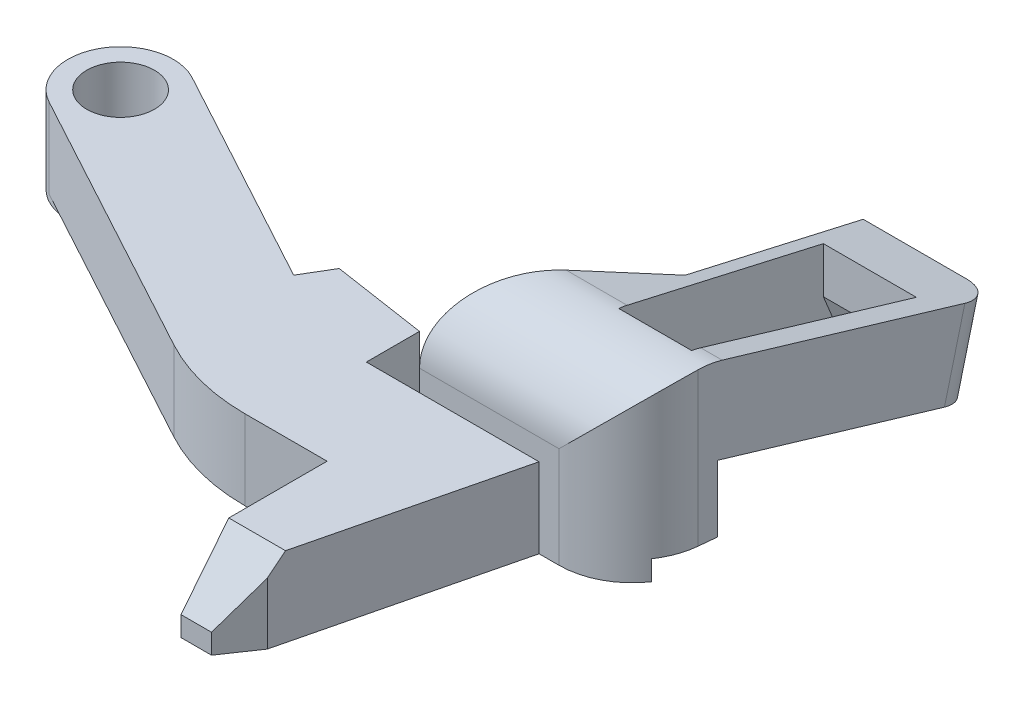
ISO-10303-21;
HEADER;
FILE_DESCRIPTION(('STEP AP214'),'2;1');
FILE_NAME('part.step','',(''),(''),'','','');
FILE_SCHEMA(('AUTOMOTIVE_DESIGN { 1 0 10303 214 1 1 1 1 }'));
ENDSEC;
DATA;
#1=APPLICATION_CONTEXT('core data for automotive mechanical design processes');
#2=APPLICATION_PROTOCOL_DEFINITION('international standard','automotive_design',2000,#1);
#3=PRODUCT_CONTEXT('',#1,'mechanical');
#4=PRODUCT('Part','Part','',(#3));
#5=PRODUCT_RELATED_PRODUCT_CATEGORY('part','',(#4));
#6=PRODUCT_DEFINITION_FORMATION('','',#4);
#7=PRODUCT_DEFINITION_CONTEXT('part definition',#1,'design');
#8=PRODUCT_DEFINITION('design','',#6,#7);
#9=PRODUCT_DEFINITION_SHAPE('','',#8);
#10=(LENGTH_UNIT() NAMED_UNIT(*) SI_UNIT(.MILLI.,.METRE.));
#11=(NAMED_UNIT(*) PLANE_ANGLE_UNIT() SI_UNIT($,.RADIAN.));
#12=(NAMED_UNIT(*) SI_UNIT($,.STERADIAN.) SOLID_ANGLE_UNIT());
#13=UNCERTAINTY_MEASURE_WITH_UNIT(LENGTH_MEASURE(1.E-05),#10,'distance_accuracy_value','');
#14=(GEOMETRIC_REPRESENTATION_CONTEXT(3) GLOBAL_UNCERTAINTY_ASSIGNED_CONTEXT((#13)) GLOBAL_UNIT_ASSIGNED_CONTEXT((#10,
#11,#12)) REPRESENTATION_CONTEXT('',''));
#15=CARTESIAN_POINT('',(0.,0.,0.));
#16=DIRECTION('',(0.,0.,1.));
#17=DIRECTION('',(1.,0.,0.));
#18=AXIS2_PLACEMENT_3D('',#15,#16,#17);
#19=CARTESIAN_POINT('',(0.,0.,0.));
#20=DIRECTION('',(0.,1.,0.));
#21=DIRECTION('',(0.,0.,1.));
#22=AXIS2_PLACEMENT_3D('',#19,#20,#21);
#23=PLANE('',#22);
#24=CARTESIAN_POINT('',(52.705,0.,3.78931625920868));
#25=DIRECTION('',(0.,1.,0.));
#26=DIRECTION('',(0.,0.,1.));
#27=AXIS2_PLACEMENT_3D('',#24,#25,#26);
#28=CIRCLE('',#27,7.00568374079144);
#29=CARTESIAN_POINT('',(52.705,0.,10.7950000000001));
#30=VERTEX_POINT('',#29);
#31=CARTESIAN_POINT('',(58.4856871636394,0.,7.747));
#32=VERTEX_POINT('',#31);
#33=EDGE_CURVE('E290',#30,#32,#28,.T.);
#34=ORIENTED_EDGE('',*,*,#33,.F.);
#35=DIRECTION('',(-1.,0.,0.));
#36=VECTOR('',#35,1.);
#37=CARTESIAN_POINT('',(62.23,0.,10.795));
#38=LINE('',#37,#36);
#39=CARTESIAN_POINT('',(50.8,0.,10.795));
#40=VERTEX_POINT('',#39);
#41=EDGE_CURVE('E356',#30,#40,#38,.T.);
#42=ORIENTED_EDGE('',*,*,#41,.T.);
#43=DIRECTION('',(0.237221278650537,0.,-0.971455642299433));
#44=VECTOR('',#43,1.);
#45=CARTESIAN_POINT('',(45.7015730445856,0.,31.6738));
#46=LINE('',#45,#44);
#47=CARTESIAN_POINT('',(45.7015730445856,0.,31.6738));
#48=VERTEX_POINT('',#47);
#49=EDGE_CURVE('E1016',#48,#40,#46,.T.);
#50=ORIENTED_EDGE('',*,*,#49,.F.);
#51=DIRECTION('',(0.562310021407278,0.,-0.826926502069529));
#52=VECTOR('',#51,1.);
#53=CARTESIAN_POINT('',(43.5425730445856,0.,34.8488));
#54=LINE('',#53,#52);
#55=CARTESIAN_POINT('',(43.5425730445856,0.,34.8488));
#56=VERTEX_POINT('',#55);
#57=EDGE_CURVE('E1013',#56,#48,#54,.T.);
#58=ORIENTED_EDGE('',*,*,#57,.F.);
#59=DIRECTION('',(1.,0.,0.));
#60=VECTOR('',#59,1.);
#61=CARTESIAN_POINT('',(40.6215730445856,0.,34.8488));
#62=LINE('',#61,#60);
#63=CARTESIAN_POINT('',(40.6215730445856,0.,34.8488));
#64=VERTEX_POINT('',#63);
#65=EDGE_CURVE('E1010',#64,#56,#62,.T.);
#66=ORIENTED_EDGE('',*,*,#65,.F.);
#67=DIRECTION('',(0.,0.,1.));
#68=VECTOR('',#67,1.);
#69=CARTESIAN_POINT('',(40.6215730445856,0.,31.6738));
#70=LINE('',#69,#68);
#71=CARTESIAN_POINT('',(40.6215730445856,0.,20.8788));
#72=VERTEX_POINT('',#71);
#73=EDGE_CURVE('E1007',#72,#64,#70,.T.);
#74=ORIENTED_EDGE('',*,*,#73,.F.);
#75=DIRECTION('',(1.,0.,0.));
#76=VECTOR('',#75,1.);
#77=CARTESIAN_POINT('',(27.9215730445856,0.,20.8788));
#78=LINE('',#77,#76);
#79=CARTESIAN_POINT('',(32.7548733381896,0.,20.8788));
#80=VERTEX_POINT('',#79);
#81=EDGE_CURVE('E422',#80,#72,#78,.T.);
#82=ORIENTED_EDGE('',*,*,#81,.F.);
#83=CARTESIAN_POINT('',(32.7548733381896,0.,1.8288));
#84=DIRECTION('',(0.,1.,0.));
#85=DIRECTION('',(0.,0.,1.));
#86=AXIS2_PLACEMENT_3D('',#83,#84,#85);
#87=CIRCLE('',#86,19.05);
#88=CARTESIAN_POINT('',(23.672898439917,0.,18.5745526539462));
#89=VERTEX_POINT('',#88);
#90=EDGE_CURVE('E464',#80,#89,#87,.F.);
#91=ORIENTED_EDGE('',*,*,#90,.T.);
#92=DIRECTION('',(0.879042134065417,0.,0.476744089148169));
#93=VECTOR('',#92,1.);
#94=CARTESIAN_POINT('',(-2.40369602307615,0.,4.43204253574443));
#95=LINE('',#94,#93);
#96=CARTESIAN_POINT('',(-2.40369602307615,0.,4.43204253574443));
#97=VERTEX_POINT('',#96);
#98=EDGE_CURVE('E419',#97,#89,#95,.T.);
#99=ORIENTED_EDGE('',*,*,#98,.F.);
#100=CARTESIAN_POINT('',(0.,0.,0.));
#101=DIRECTION('',(0.,-1.,0.));
#102=DIRECTION('',(0.,0.,-1.));
#103=AXIS2_PLACEMENT_3D('',#100,#101,#102);
#104=CIRCLE('',#103,5.0419);
#105=CARTESIAN_POINT('',(2.40369602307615,0.,-4.43204253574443));
#106=VERTEX_POINT('',#105);
#107=EDGE_CURVE('E406',#106,#97,#104,.T.);
#108=ORIENTED_EDGE('',*,*,#107,.F.);
#109=DIRECTION('',(-0.879042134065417,0.,-0.476744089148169));
#110=VECTOR('',#109,1.);
#111=CARTESIAN_POINT('',(2.40369602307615,0.,-4.43204253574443));
#112=LINE('',#111,#110);
#113=CARTESIAN_POINT('',(23.622,0.,7.07559812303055));
#114=VERTEX_POINT('',#113);
#115=EDGE_CURVE('E434',#114,#106,#112,.T.);
#116=ORIENTED_EDGE('',*,*,#115,.F.);
#117=CARTESIAN_POINT('',(30.48,0.,10.795));
#118=VERTEX_POINT('',#117);
#119=EDGE_CURVE('E431',#118,#114,#112,.T.);
#120=ORIENTED_EDGE('',*,*,#119,.F.);
#121=DIRECTION('',(1.,0.,0.));
#122=VECTOR('',#121,1.);
#123=CARTESIAN_POINT('',(0.,0.,10.795));
#124=LINE('',#123,#122);
#125=CARTESIAN_POINT('',(34.29,0.,10.795));
#126=VERTEX_POINT('',#125);
#127=EDGE_CURVE('E400',#118,#126,#124,.T.);
#128=ORIENTED_EDGE('',*,*,#127,.T.);
#129=DIRECTION('',(-1.,0.,0.));
#130=VECTOR('',#129,1.);
#131=CARTESIAN_POINT('',(30.48,0.,10.795));
#132=LINE('',#131,#130);
#133=CARTESIAN_POINT('',(39.37,0.,10.795));
#134=VERTEX_POINT('',#133);
#135=EDGE_CURVE('E442',#134,#126,#132,.T.);
#136=ORIENTED_EDGE('',*,*,#135,.F.);
#137=DIRECTION('',(-0.554700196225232,0.,0.832050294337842));
#138=VECTOR('',#137,1.);
#139=CARTESIAN_POINT('',(32.2384615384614,0.,21.4923076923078));
#140=LINE('',#139,#138);
#141=CARTESIAN_POINT('',(41.402,0.,7.747));
#142=VERTEX_POINT('',#141);
#143=EDGE_CURVE('E326',#142,#134,#140,.T.);
#144=ORIENTED_EDGE('',*,*,#143,.F.);
#145=DIRECTION('',(-1.,0.,0.));
#146=VECTOR('',#145,1.);
#147=CARTESIAN_POINT('',(62.23,0.,7.747));
#148=LINE('',#147,#146);
#149=EDGE_CURVE('E354',#32,#142,#148,.T.);
#150=ORIENTED_EDGE('',*,*,#149,.F.);
#151=EDGE_LOOP('',(#34,#42,#50,#58,#66,#74,#82,#91,#99,#108,#116,#120,#128,#136,#144,#150));
#152=FACE_BOUND('',#151,.T.);
#153=ADVANCED_FACE('F33',(#152),#23,.F.);
#154=CARTESIAN_POINT('',(62.23,9.652,3.90842047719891));
#155=DIRECTION('',(-1.,0.,0.));
#156=DIRECTION('',(0.,0.,1.));
#157=AXIS2_PLACEMENT_3D('',#154,#155,#156);
#158=CYLINDRICAL_SURFACE('',#157,6.8865795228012);
#159=CARTESIAN_POINT('',(59.6769944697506,16.5151885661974,4.47553618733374));
#160=CARTESIAN_POINT('',(59.6609347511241,16.5017118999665,4.63912438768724));
#161=CARTESIAN_POINT('',(59.6390912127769,16.4823595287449,4.80159530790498));
#162=CARTESIAN_POINT('',(59.5845212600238,16.4325989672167,5.1227843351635));
#163=CARTESIAN_POINT('',(59.5518078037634,16.4022039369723,5.28150667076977));
#164=CARTESIAN_POINT('',(59.4765016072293,16.3313572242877,5.5925877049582));
#165=CARTESIAN_POINT('',(59.4340058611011,16.2910040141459,5.7449925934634));
#166=CARTESIAN_POINT('',(59.3397714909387,16.2009155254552,6.04408807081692));
#167=CARTESIAN_POINT('',(59.2880304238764,16.1511777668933,6.19077713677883));
#168=CARTESIAN_POINT('',(59.1764499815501,16.0434677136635,6.47695752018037));
#169=CARTESIAN_POINT('',(59.1166519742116,15.9855374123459,6.61648088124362));
#170=CARTESIAN_POINT('',(58.9896079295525,15.8621162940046,6.88865171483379));
#171=CARTESIAN_POINT('',(58.922359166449,15.7966227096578,7.02129664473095));
#172=CARTESIAN_POINT('',(58.7104065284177,15.5897910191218,7.40891821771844));
#173=CARTESIAN_POINT('',(58.5556984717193,15.4382974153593,7.65307542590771));
#174=CARTESIAN_POINT('',(58.1431237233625,15.0333604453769,8.22621676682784));
#175=CARTESIAN_POINT('',(57.8723352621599,14.7667968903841,8.53663525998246));
#176=CARTESIAN_POINT('',(57.4431019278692,14.343524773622,8.95361414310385));
#177=CARTESIAN_POINT('',(57.2959523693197,14.1983021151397,9.08465337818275));
#178=CARTESIAN_POINT('',(56.9952120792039,13.9013115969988,9.33110683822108));
#179=CARTESIAN_POINT('',(56.8416213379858,13.7495437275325,9.44652103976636));
#180=CARTESIAN_POINT('',(56.4713994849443,13.3835410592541,9.70214354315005));
#181=CARTESIAN_POINT('',(56.252481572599,13.1669819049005,9.83571161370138));
#182=CARTESIAN_POINT('',(55.8073404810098,12.7264370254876,10.0757342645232));
#183=CARTESIAN_POINT('',(55.581114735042,12.502448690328,10.1821791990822));
#184=CARTESIAN_POINT('',(55.123558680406,12.049276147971,10.3689184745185));
#185=CARTESIAN_POINT('',(54.8922327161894,11.8200963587,10.4492342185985));
#186=CARTESIAN_POINT('',(54.4260397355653,11.3581327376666,10.5846509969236));
#187=CARTESIAN_POINT('',(54.1911729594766,11.1253491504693,10.6397537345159));
#188=CARTESIAN_POINT('',(53.5446295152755,10.4844612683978,10.756998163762));
#189=CARTESIAN_POINT('',(53.1304653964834,10.0738332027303,10.7942884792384));
#190=CARTESIAN_POINT('',(52.7129250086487,9.65985735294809,10.7949966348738));
#191=CARTESIAN_POINT('',(52.7089624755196,9.65592864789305,10.794999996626));
#192=CARTESIAN_POINT('',(52.705,9.652,10.7950000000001));
#193=B_SPLINE_CURVE_WITH_KNOTS('',3,(#159,#160,#161,#162,#163,#164,#165,#166,#167,#168,#169,
#170,#171,#172,#173,#174,#175,#176,#177,#178,#179,#180,#181,#182,#183,#184,#185,#186,#187,#188,
#189,#190,#191,#192),.UNSPECIFIED.,.F.,.F.,(4,2,2,2,2,2,2,2,2,2,2,2,2,2,2,2,4),(0.,
0.494477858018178,0.988368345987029,1.47755800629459,1.96687712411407,2.45377334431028,
2.94084828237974,3.9167172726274,5.38015182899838,6.11399880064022,6.84784687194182,
7.85338627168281,8.85928277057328,9.86435322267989,10.8693557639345,12.6165200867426,
12.6332600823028),.UNSPECIFIED.);
#194=CARTESIAN_POINT('',(59.6769944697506,16.5151885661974,4.47553618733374));
#195=VERTEX_POINT('',#194);
#196=CARTESIAN_POINT('',(52.705,9.652,10.7950000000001));
#197=VERTEX_POINT('',#196);
#198=EDGE_CURVE('E270',#195,#197,#193,.T.);
#199=ORIENTED_EDGE('',*,*,#198,.F.);
#200=CARTESIAN_POINT('',(59.7328129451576,9.652,3.90842047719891));
#201=DIRECTION('',(0.995191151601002,0.,0.0979518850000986));
#202=DIRECTION('',(-0.0979518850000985,0.,0.995191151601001));
#203=AXIS2_PLACEMENT_3D('',#200,#201,#202);
#204=ELLIPSE('',#203,6.91985606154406,6.8865795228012);
#205=CARTESIAN_POINT('',(59.8834380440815,16.366387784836,2.37806947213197));
#206=VERTEX_POINT('',#205);
#207=EDGE_CURVE('E285',#206,#195,#204,.T.);
#208=ORIENTED_EDGE('',*,*,#207,.F.);
#209=DIRECTION('',(-1.,0.,0.));
#210=VECTOR('',#209,1.);
#211=CARTESIAN_POINT('',(62.23,16.366387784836,2.37806947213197));
#212=LINE('',#211,#210);
#213=CARTESIAN_POINT('',(57.8416192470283,16.366387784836,2.37806947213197));
#214=VERTEX_POINT('',#213);
#215=EDGE_CURVE('E360',#206,#214,#212,.T.);
#216=ORIENTED_EDGE('',*,*,#215,.T.);
#217=CARTESIAN_POINT('',(57.6909941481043,9.652,3.90842047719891));
#218=DIRECTION('',(0.995191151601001,0.,0.0979518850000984));
#219=DIRECTION('',(-0.0979518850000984,0.,0.995191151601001));
#220=AXIS2_PLACEMENT_3D('',#217,#218,#219);
#221=ELLIPSE('',#220,6.91985606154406,6.8865795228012);
#222=CARTESIAN_POINT('',(57.7631812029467,16.4994135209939,3.17500000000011));
#223=VERTEX_POINT('',#222);
#224=EDGE_CURVE('E510',#214,#223,#221,.T.);
#225=ORIENTED_EDGE('',*,*,#224,.T.);
#226=DIRECTION('',(-1.,0.,0.));
#227=VECTOR('',#226,1.);
#228=CARTESIAN_POINT('',(62.23,16.4994135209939,3.17500000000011));
#229=LINE('',#228,#227);
#230=CARTESIAN_POINT('',(50.8,16.4994135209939,3.17500000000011));
#231=VERTEX_POINT('',#230);
#232=EDGE_CURVE('E296',#223,#231,#229,.T.);
#233=ORIENTED_EDGE('',*,*,#232,.T.);
#234=CARTESIAN_POINT('',(50.8,9.652,3.90842047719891));
#235=DIRECTION('',(-1.,0.,0.));
#236=DIRECTION('',(0.,0.,1.));
#237=AXIS2_PLACEMENT_3D('',#234,#235,#236);
#238=CIRCLE('',#237,6.8865795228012);
#239=CARTESIAN_POINT('',(50.8,16.366387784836,2.37806947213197));
#240=VERTEX_POINT('',#239);
#241=EDGE_CURVE('E522',#231,#240,#238,.T.);
#242=ORIENTED_EDGE('',*,*,#241,.T.);
#243=CARTESIAN_POINT('',(44.9812870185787,16.366387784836,2.37806947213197));
#244=VERTEX_POINT('',#243);
#245=EDGE_CURVE('E359',#240,#244,#212,.T.);
#246=ORIENTED_EDGE('',*,*,#245,.T.);
#247=CARTESIAN_POINT('',(43.9610530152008,9.652,3.90842047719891));
#248=DIRECTION('',(-0.832050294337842,0.,-0.554700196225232));
#249=DIRECTION('',(-0.554700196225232,0.,0.832050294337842));
#250=AXIS2_PLACEMENT_3D('',#247,#248,#249);
#251=ELLIPSE('',#250,8.27663852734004,6.8865795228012);
#252=CARTESIAN_POINT('',(39.37,9.652,10.795));
#253=VERTEX_POINT('',#252);
#254=EDGE_CURVE('E328',#253,#244,#251,.T.);
#255=ORIENTED_EDGE('',*,*,#254,.F.);
#256=DIRECTION('',(-1.,0.,0.));
#257=VECTOR('',#256,1.);
#258=CARTESIAN_POINT('',(62.23,9.652,10.7950000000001));
#259=LINE('',#258,#257);
#260=EDGE_CURVE('E288',#197,#253,#259,.T.);
#261=ORIENTED_EDGE('',*,*,#260,.F.);
#262=EDGE_LOOP('',(#199,#208,#216,#225,#233,#242,#246,#255,#261));
#263=FACE_BOUND('',#262,.T.);
#264=ADVANCED_FACE('F283',(#263),#158,.T.);
#265=CARTESIAN_POINT('',(62.23,0.,7.747));
#266=DIRECTION('',(0.,0.,1.));
#267=DIRECTION('',(1.,0.,0.));
#268=AXIS2_PLACEMENT_3D('',#265,#266,#267);
#269=PLANE('',#268);
#270=DIRECTION('',(0.,1.,0.));
#271=VECTOR('',#270,1.);
#272=CARTESIAN_POINT('',(58.4856871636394,-2.54,7.747));
#273=LINE('',#272,#271);
#274=CARTESIAN_POINT('',(58.4856871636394,1.905,7.747));
#275=VERTEX_POINT('',#274);
#276=EDGE_CURVE('E573',#32,#275,#273,.T.);
#277=ORIENTED_EDGE('',*,*,#276,.F.);
#278=ORIENTED_EDGE('',*,*,#149,.T.);
#279=DIRECTION('',(0.,-1.,0.));
#280=VECTOR('',#279,1.);
#281=CARTESIAN_POINT('',(41.402,0.,7.747));
#282=LINE('',#281,#280);
#283=CARTESIAN_POINT('',(41.402,1.905,7.747));
#284=VERTEX_POINT('',#283);
#285=EDGE_CURVE('E323',#284,#142,#282,.T.);
#286=ORIENTED_EDGE('',*,*,#285,.F.);
#287=DIRECTION('',(-1.,0.,0.));
#288=VECTOR('',#287,1.);
#289=CARTESIAN_POINT('',(62.23,1.905,7.747));
#290=LINE('',#289,#288);
#291=EDGE_CURVE('E352',#275,#284,#290,.T.);
#292=ORIENTED_EDGE('',*,*,#291,.F.);
#293=EDGE_LOOP('',(#277,#278,#286,#292));
#294=FACE_BOUND('',#293,.T.);
#295=ADVANCED_FACE('F571',(#294),#269,.F.);
#296=CARTESIAN_POINT('',(62.23,1.905,7.747));
#297=DIRECTION('',(0.,1.,0.));
#298=DIRECTION('',(0.,0.,1.));
#299=AXIS2_PLACEMENT_3D('',#296,#297,#298);
#300=PLANE('',#299);
#301=CARTESIAN_POINT('',(52.705,1.905,3.78931625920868));
#302=DIRECTION('',(0.,1.,0.));
#303=DIRECTION('',(0.,0.,1.));
#304=AXIS2_PLACEMENT_3D('',#301,#302,#303);
#305=CIRCLE('',#304,7.00568374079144);
#306=CARTESIAN_POINT('',(59.6769944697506,1.905,4.47553618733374));
#307=VERTEX_POINT('',#306);
#308=EDGE_CURVE('E273',#275,#307,#305,.T.);
#309=ORIENTED_EDGE('',*,*,#308,.F.);
#310=ORIENTED_EDGE('',*,*,#291,.T.);
#311=DIRECTION('',(-0.554700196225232,0.,0.832050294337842));
#312=VECTOR('',#311,1.);
#313=CARTESIAN_POINT('',(47.8106153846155,1.905,-1.8659230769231));
#314=LINE('',#313,#312);
#315=CARTESIAN_POINT('',(44.704,1.905,2.79400000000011));
#316=VERTEX_POINT('',#315);
#317=EDGE_CURVE('E320',#316,#284,#314,.T.);
#318=ORIENTED_EDGE('',*,*,#317,.F.);
#319=DIRECTION('',(-1.,0.,0.));
#320=VECTOR('',#319,1.);
#321=CARTESIAN_POINT('',(62.23,1.905,2.79400000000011));
#322=LINE('',#321,#320);
#323=CARTESIAN_POINT('',(50.8,1.905,2.79400000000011));
#324=VERTEX_POINT('',#323);
#325=EDGE_CURVE('E348',#324,#316,#322,.T.);
#326=ORIENTED_EDGE('',*,*,#325,.F.);
#327=DIRECTION('',(0.,0.,1.));
#328=VECTOR('',#327,1.);
#329=CARTESIAN_POINT('',(50.8,1.905,7.747));
#330=LINE('',#329,#328);
#331=CARTESIAN_POINT('',(50.8,1.905,3.17500000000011));
#332=VERTEX_POINT('',#331);
#333=EDGE_CURVE('E519',#324,#332,#330,.T.);
#334=ORIENTED_EDGE('',*,*,#333,.T.);
#335=DIRECTION('',(1.,0.,0.));
#336=VECTOR('',#335,1.);
#337=CARTESIAN_POINT('',(62.23,1.905,3.17500000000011));
#338=LINE('',#337,#336);
#339=CARTESIAN_POINT('',(57.7631812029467,1.905,3.17500000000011));
#340=VERTEX_POINT('',#339);
#341=EDGE_CURVE('E455',#332,#340,#338,.T.);
#342=ORIENTED_EDGE('',*,*,#341,.T.);
#343=DIRECTION('',(0.0979518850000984,0.,-0.995191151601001));
#344=VECTOR('',#343,1.);
#345=CARTESIAN_POINT('',(57.3603559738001,1.905,7.26770432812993));
#346=LINE('',#345,#344);
#347=CARTESIAN_POINT('',(57.8006812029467,1.905,2.79400000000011));
#348=VERTEX_POINT('',#347);
#349=EDGE_CURVE('E507',#340,#348,#346,.T.);
#350=ORIENTED_EDGE('',*,*,#349,.T.);
#351=CARTESIAN_POINT('',(59.8425,1.905,2.79400000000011));
#352=VERTEX_POINT('',#351);
#353=EDGE_CURVE('E349',#352,#348,#322,.T.);
#354=ORIENTED_EDGE('',*,*,#353,.F.);
#355=DIRECTION('',(0.0979518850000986,0.,-0.995191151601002));
#356=VECTOR('',#355,1.);
#357=CARTESIAN_POINT('',(59.3825843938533,1.905,7.46674255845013));
#358=LINE('',#357,#356);
#359=EDGE_CURVE('E309',#307,#352,#358,.T.);
#360=ORIENTED_EDGE('',*,*,#359,.F.);
#361=EDGE_LOOP('',(#309,#310,#318,#326,#334,#342,#350,#354,#360));
#362=FACE_BOUND('',#361,.T.);
#363=ADVANCED_FACE('F537',(#362),#300,.F.);
#364=CARTESIAN_POINT('',(62.23,1.905,2.79400000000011));
#365=DIRECTION('',(0.,0.,1.));
#366=DIRECTION('',(1.,0.,0.));
#367=AXIS2_PLACEMENT_3D('',#364,#365,#366);
#368=PLANE('',#367);
#369=DIRECTION('',(-1.,0.,0.));
#370=VECTOR('',#369,1.);
#371=CARTESIAN_POINT('',(62.23,8.255,2.79400000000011));
#372=LINE('',#371,#370);
#373=CARTESIAN_POINT('',(50.8,8.255,2.79400000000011));
#374=VERTEX_POINT('',#373);
#375=CARTESIAN_POINT('',(44.704,8.255,2.79400000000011));
#376=VERTEX_POINT('',#375);
#377=EDGE_CURVE('E344',#374,#376,#372,.T.);
#378=ORIENTED_EDGE('',*,*,#377,.F.);
#379=DIRECTION('',(0.,-1.,0.));
#380=VECTOR('',#379,1.);
#381=CARTESIAN_POINT('',(50.8,1.905,2.79400000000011));
#382=LINE('',#381,#380);
#383=EDGE_CURVE('E516',#374,#324,#382,.T.);
#384=ORIENTED_EDGE('',*,*,#383,.T.);
#385=ORIENTED_EDGE('',*,*,#325,.T.);
#386=DIRECTION('',(0.,-1.,0.));
#387=VECTOR('',#386,1.);
#388=CARTESIAN_POINT('',(44.704,1.905,2.79400000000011));
#389=LINE('',#388,#387);
#390=EDGE_CURVE('E317',#376,#316,#389,.T.);
#391=ORIENTED_EDGE('',*,*,#390,.F.);
#392=EDGE_LOOP('',(#378,#384,#385,#391));
#393=FACE_BOUND('',#392,.T.);
#394=ADVANCED_FACE('F564',(#393),#368,.F.);
#395=CARTESIAN_POINT('',(62.23,3.13156040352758,-19.6849999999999));
#396=DIRECTION('',(0.,0.222222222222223,0.974996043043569));
#397=DIRECTION('',(0.,-0.974996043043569,0.222222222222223));
#398=AXIS2_PLACEMENT_3D('',#395,#396,#397);
#399=PLANE('',#398);
#400=DIRECTION('',(-1.,0.,0.));
#401=VECTOR('',#400,1.);
#402=CARTESIAN_POINT('',(62.23,10.9325037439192,-21.4629999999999));
#403=LINE('',#402,#401);
#404=CARTESIAN_POINT('',(59.4339774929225,10.9325037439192,-21.4629999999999));
#405=VERTEX_POINT('',#404);
#406=CARTESIAN_POINT('',(49.53,10.9325037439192,-21.4629999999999));
#407=VERTEX_POINT('',#406);
#408=EDGE_CURVE('E362',#405,#407,#403,.T.);
#409=ORIENTED_EDGE('',*,*,#408,.F.);
#410=DIRECTION('',(0.021867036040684,0.974762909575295,-0.22216908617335));
#411=VECTOR('',#410,1.);
#412=CARTESIAN_POINT('',(59.2603144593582,3.19115811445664,-19.6985835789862));
#413=LINE('',#412,#411);
#414=CARTESIAN_POINT('',(59.2589774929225,3.13156040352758,-19.6849999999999));
#415=VERTEX_POINT('',#414);
#416=EDGE_CURVE('E474',#405,#415,#413,.F.);
#417=ORIENTED_EDGE('',*,*,#416,.T.);
#418=DIRECTION('',(-1.,0.,0.));
#419=VECTOR('',#418,1.);
#420=CARTESIAN_POINT('',(62.23,3.13156040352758,-19.6849999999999));
#421=LINE('',#420,#419);
#422=CARTESIAN_POINT('',(49.53,3.13156040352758,-19.6849999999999));
#423=VERTEX_POINT('',#422);
#424=EDGE_CURVE('E342',#415,#423,#421,.T.);
#425=ORIENTED_EDGE('',*,*,#424,.T.);
#426=DIRECTION('',(0.,-0.974996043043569,0.222222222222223));
#427=VECTOR('',#426,1.);
#428=CARTESIAN_POINT('',(49.53,3.13156040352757,-19.6849999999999));
#429=LINE('',#428,#427);
#430=EDGE_CURVE('E333',#407,#423,#429,.T.);
#431=ORIENTED_EDGE('',*,*,#430,.F.);
#432=EDGE_LOOP('',(#409,#417,#425,#431));
#433=FACE_BOUND('',#432,.T.);
#434=ADVANCED_FACE('F554',(#433),#399,.F.);
#435=CARTESIAN_POINT('',(62.23,10.9325037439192,-21.4629999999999));
#436=DIRECTION('',(0.,-0.974996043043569,0.222222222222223));
#437=DIRECTION('',(0.,-0.222222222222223,-0.974996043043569));
#438=AXIS2_PLACEMENT_3D('',#435,#436,#437);
#439=PLANE('',#438);
#440=DIRECTION('',(-0.0955253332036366,0.221205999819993,0.970537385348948));
#441=VECTOR('',#440,1.);
#442=CARTESIAN_POINT('',(62.23,10.9325037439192,-21.4629999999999));
#443=LINE('',#442,#441);
#444=CARTESIAN_POINT('',(61.96297230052,11.5508541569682,-18.7499985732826));
#445=VERTEX_POINT('',#444);
#446=EDGE_CURVE('E295',#445,#206,#443,.T.);
#447=ORIENTED_EDGE('',*,*,#446,.F.);
#448=CARTESIAN_POINT('',(59.4339774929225,11.4969481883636,-18.9865100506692));
#449=DIRECTION('',(0.,-0.974996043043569,0.222222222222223));
#450=DIRECTION('',(-1.,0.,0.));
#451=AXIS2_PLACEMENT_3D('',#448,#449,#450);
#452=ELLIPSE('',#451,2.54060749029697,2.54);
#453=EDGE_CURVE('E472',#445,#405,#452,.F.);
#454=ORIENTED_EDGE('',*,*,#453,.T.);
#455=ORIENTED_EDGE('',*,*,#408,.T.);
#456=DIRECTION('',(0.,-0.222222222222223,-0.974996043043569));
#457=VECTOR('',#456,1.);
#458=CARTESIAN_POINT('',(49.53,10.9325037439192,-21.4629999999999));
#459=LINE('',#458,#457);
#460=CARTESIAN_POINT('',(49.53,14.8112659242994,-4.44499999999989));
#461=VERTEX_POINT('',#460);
#462=EDGE_CURVE('E336',#461,#407,#459,.T.);
#463=ORIENTED_EDGE('',*,*,#462,.F.);
#464=DIRECTION('',(0.544986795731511,-0.186321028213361,-0.817480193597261));
#465=VECTOR('',#464,1.);
#466=CARTESIAN_POINT('',(61.2776837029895,10.7949475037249,-22.0665255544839));
#467=LINE('',#466,#465);
#468=EDGE_CURVE('E331',#244,#461,#467,.T.);
#469=ORIENTED_EDGE('',*,*,#468,.F.);
#470=ORIENTED_EDGE('',*,*,#245,.F.);
#471=DIRECTION('',(0.,-0.222222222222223,-0.974996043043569));
#472=VECTOR('',#471,1.);
#473=CARTESIAN_POINT('',(50.8,10.9325037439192,-21.4629999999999));
#474=LINE('',#473,#472);
#475=CARTESIAN_POINT('',(50.8,12.0903432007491,-16.3829999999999));
#476=VERTEX_POINT('',#475);
#477=EDGE_CURVE('E301',#240,#476,#474,.T.);
#478=ORIENTED_EDGE('',*,*,#477,.T.);
#479=DIRECTION('',(1.,0.,0.));
#480=VECTOR('',#479,1.);
#481=CARTESIAN_POINT('',(62.23,12.0903432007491,-16.3829999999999));
#482=LINE('',#481,#480);
#483=CARTESIAN_POINT('',(59.6881812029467,12.0903432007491,-16.3829999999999));
#484=VERTEX_POINT('',#483);
#485=EDGE_CURVE('E514',#476,#484,#482,.T.);
#486=ORIENTED_EDGE('',*,*,#485,.T.);
#487=DIRECTION('',(-0.0955253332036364,0.221205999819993,0.970537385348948));
#488=VECTOR('',#487,1.);
#489=CARTESIAN_POINT('',(60.2068129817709,10.889358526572,-21.6522988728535));
#490=LINE('',#489,#488);
#491=EDGE_CURVE('E491',#484,#214,#490,.T.);
#492=ORIENTED_EDGE('',*,*,#491,.T.);
#493=ORIENTED_EDGE('',*,*,#215,.F.);
#494=EDGE_LOOP('',(#447,#454,#455,#463,#469,#470,#478,#486,#492,#493));
#495=FACE_BOUND('',#494,.T.);
#496=ADVANCED_FACE('F527',(#495),#439,.F.);
#497=ORIENTED_EDGE('',*,*,#353,.T.);
#498=DIRECTION('',(0.,1.,0.));
#499=VECTOR('',#498,1.);
#500=CARTESIAN_POINT('',(57.8006812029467,1.905,2.79400000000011));
#501=LINE('',#500,#499);
#502=CARTESIAN_POINT('',(57.8006812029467,8.255,2.79400000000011));
#503=VERTEX_POINT('',#502);
#504=EDGE_CURVE('E497',#348,#503,#501,.T.);
#505=ORIENTED_EDGE('',*,*,#504,.T.);
#506=CARTESIAN_POINT('',(59.8425,8.255,2.79400000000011));
#507=VERTEX_POINT('',#506);
#508=EDGE_CURVE('E345',#507,#503,#372,.T.);
#509=ORIENTED_EDGE('',*,*,#508,.F.);
#510=DIRECTION('',(0.,1.,0.));
#511=VECTOR('',#510,1.);
#512=CARTESIAN_POINT('',(59.8425,1.905,2.79400000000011));
#513=LINE('',#512,#511);
#514=EDGE_CURVE('E307',#352,#507,#513,.T.);
#515=ORIENTED_EDGE('',*,*,#514,.F.);
#516=EDGE_LOOP('',(#497,#505,#509,#515));
#517=FACE_BOUND('',#516,.T.);
#518=ADVANCED_FACE('F540',(#517),#368,.F.);
#519=CARTESIAN_POINT('',(62.23,8.255,2.79400000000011));
#520=DIRECTION('',(0.,0.974996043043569,-0.222222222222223));
#521=DIRECTION('',(0.,0.222222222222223,0.974996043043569));
#522=AXIS2_PLACEMENT_3D('',#519,#520,#521);
#523=PLANE('',#522);
#524=DIRECTION('',(-1.,0.,0.));
#525=VECTOR('',#524,1.);
#526=CARTESIAN_POINT('',(62.23,3.48904493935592,-18.1165429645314));
#527=LINE('',#526,#525);
#528=CARTESIAN_POINT('',(59.8588055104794,3.48904493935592,-18.1165429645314));
#529=VERTEX_POINT('',#528);
#530=CARTESIAN_POINT('',(50.8,3.48904493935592,-18.1165429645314));
#531=VERTEX_POINT('',#530);
#532=EDGE_CURVE('E277',#529,#531,#527,.T.);
#533=ORIENTED_EDGE('',*,*,#532,.T.);
#534=DIRECTION('',(0.,0.222222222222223,0.974996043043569));
#535=VECTOR('',#534,1.);
#536=CARTESIAN_POINT('',(50.8,8.255,2.79400000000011));
#537=LINE('',#536,#535);
#538=EDGE_CURVE('E452',#531,#374,#537,.T.);
#539=ORIENTED_EDGE('',*,*,#538,.T.);
#540=ORIENTED_EDGE('',*,*,#377,.T.);
#541=DIRECTION('',(-0.544986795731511,0.186321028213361,0.817480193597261));
#542=VECTOR('',#541,1.);
#543=CARTESIAN_POINT('',(49.9094079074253,6.47536614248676,-5.01411186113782));
#544=LINE('',#543,#542);
#545=CARTESIAN_POINT('',(49.53,6.60507877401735,-4.44499999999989));
#546=VERTEX_POINT('',#545);
#547=EDGE_CURVE('E314',#546,#376,#544,.T.);
#548=ORIENTED_EDGE('',*,*,#547,.F.);
#549=DIRECTION('',(0.,0.222222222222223,0.974996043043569));
#550=VECTOR('',#549,1.);
#551=CARTESIAN_POINT('',(49.53,8.255,2.79400000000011));
#552=LINE('',#551,#550);
#553=EDGE_CURVE('E448',#423,#546,#552,.T.);
#554=ORIENTED_EDGE('',*,*,#553,.F.);
#555=ORIENTED_EDGE('',*,*,#424,.F.);
#556=CARTESIAN_POINT('',(59.2589774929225,3.69600484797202,-17.2085100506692));
#557=DIRECTION('',(0.,0.974996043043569,-0.222222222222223));
#558=DIRECTION('',(-1.,0.,0.));
#559=AXIS2_PLACEMENT_3D('',#556,#557,#558);
#560=ELLIPSE('',#559,2.54060749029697,2.54);
#561=CARTESIAN_POINT('',(61.78797230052,3.74991081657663,-16.9719985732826));
#562=VERTEX_POINT('',#561);
#563=EDGE_CURVE('E278',#415,#562,#560,.F.);
#564=ORIENTED_EDGE('',*,*,#563,.T.);
#565=DIRECTION('',(0.0955253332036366,-0.221205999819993,-0.970537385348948));
#566=VECTOR('',#565,1.);
#567=CARTESIAN_POINT('',(59.8642861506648,8.20455027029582,2.57265270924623));
#568=LINE('',#567,#566);
#569=EDGE_CURVE('E298',#507,#562,#568,.T.);
#570=ORIENTED_EDGE('',*,*,#569,.F.);
#571=ORIENTED_EDGE('',*,*,#508,.T.);
#572=DIRECTION('',(0.0955253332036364,-0.221205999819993,-0.970537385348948));
#573=VECTOR('',#572,1.);
#574=CARTESIAN_POINT('',(57.8410991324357,8.16140505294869,2.38335383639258));
#575=LINE('',#574,#573);
#576=EDGE_CURVE('E450',#503,#529,#575,.T.);
#577=ORIENTED_EDGE('',*,*,#576,.T.);
#578=EDGE_LOOP('',(#533,#539,#540,#548,#554,#555,#564,#570,#571,#577));
#579=FACE_BOUND('',#578,.T.);
#580=ADVANCED_FACE('F481',(#579),#523,.F.);
#581=CARTESIAN_POINT('',(62.23,7.62,10.795));
#582=DIRECTION('',(0.,0.,-1.));
#583=DIRECTION('',(-1.,0.,0.));
#584=AXIS2_PLACEMENT_3D('',#581,#582,#583);
#585=PLANE('',#584);
#586=ORIENTED_EDGE('',*,*,#41,.F.);
#587=DIRECTION('',(0.,1.,0.));
#588=VECTOR('',#587,1.);
#589=CARTESIAN_POINT('',(52.705,-2.54,10.7950000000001));
#590=LINE('',#589,#588);
#591=EDGE_CURVE('E596',#30,#197,#590,.T.);
#592=ORIENTED_EDGE('',*,*,#591,.T.);
#593=ORIENTED_EDGE('',*,*,#260,.T.);
#594=DIRECTION('',(0.,-1.,0.));
#595=VECTOR('',#594,1.);
#596=CARTESIAN_POINT('',(39.37,7.62,10.795));
#597=LINE('',#596,#595);
#598=CARTESIAN_POINT('',(39.37,7.62,10.795));
#599=VERTEX_POINT('',#598);
#600=EDGE_CURVE('E339',#253,#599,#597,.T.);
#601=ORIENTED_EDGE('',*,*,#600,.T.);
#602=DIRECTION('',(-1.,0.,0.));
#603=VECTOR('',#602,1.);
#604=CARTESIAN_POINT('',(30.48,7.62,10.795));
#605=LINE('',#604,#603);
#606=CARTESIAN_POINT('',(50.8,7.62,10.795));
#607=VERTEX_POINT('',#606);
#608=EDGE_CURVE('E589',#607,#599,#605,.T.);
#609=ORIENTED_EDGE('',*,*,#608,.F.);
#610=DIRECTION('',(0.,-1.,0.));
#611=VECTOR('',#610,1.);
#612=CARTESIAN_POINT('',(50.8,7.62,10.795));
#613=LINE('',#612,#611);
#614=EDGE_CURVE('E1000',#607,#40,#613,.T.);
#615=ORIENTED_EDGE('',*,*,#614,.T.);
#616=EDGE_LOOP('',(#586,#592,#593,#601,#609,#615));
#617=FACE_BOUND('',#616,.T.);
#618=ADVANCED_FACE('F594',(#617),#585,.F.);
#619=CARTESIAN_POINT('',(30.48,7.62,10.795));
#620=DIRECTION('',(0.,0.,1.));
#621=DIRECTION('',(1.,0.,0.));
#622=AXIS2_PLACEMENT_3D('',#619,#620,#621);
#623=PLANE('',#622);
#624=ORIENTED_EDGE('',*,*,#135,.T.);
#625=DIRECTION('',(0.,1.,0.));
#626=VECTOR('',#625,1.);
#627=CARTESIAN_POINT('',(34.29,-2.54,10.795));
#628=LINE('',#627,#626);
#629=CARTESIAN_POINT('',(34.29,7.62,10.795));
#630=VERTEX_POINT('',#629);
#631=EDGE_CURVE('E388',#126,#630,#628,.T.);
#632=ORIENTED_EDGE('',*,*,#631,.T.);
#633=EDGE_CURVE('E586',#599,#630,#605,.T.);
#634=ORIENTED_EDGE('',*,*,#633,.F.);
#635=DIRECTION('',(0.,1.,0.));
#636=VECTOR('',#635,1.);
#637=CARTESIAN_POINT('',(39.37,7.62,10.795));
#638=LINE('',#637,#636);
#639=EDGE_CURVE('E446',#134,#599,#638,.T.);
#640=ORIENTED_EDGE('',*,*,#639,.F.);
#641=EDGE_LOOP('',(#624,#632,#634,#640));
#642=FACE_BOUND('',#641,.T.);
#643=ADVANCED_FACE('F583',(#642),#623,.F.);
#644=CARTESIAN_POINT('',(2.40369602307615,7.62,-4.43204253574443));
#645=DIRECTION('',(-0.476744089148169,0.,0.879042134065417));
#646=DIRECTION('',(0.879042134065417,0.,0.476744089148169));
#647=AXIS2_PLACEMENT_3D('',#644,#645,#646);
#648=PLANE('',#647);
#649=DIRECTION('',(0.,1.,0.));
#650=VECTOR('',#649,1.);
#651=CARTESIAN_POINT('',(23.622,7.62,7.07559812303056));
#652=LINE('',#651,#650);
#653=CARTESIAN_POINT('',(23.622,7.62,7.07559812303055));
#654=VERTEX_POINT('',#653);
#655=EDGE_CURVE('E428',#114,#654,#652,.T.);
#656=ORIENTED_EDGE('',*,*,#655,.F.);
#657=ORIENTED_EDGE('',*,*,#115,.T.);
#658=DIRECTION('',(0.,-1.,0.));
#659=VECTOR('',#658,1.);
#660=CARTESIAN_POINT('',(2.40369602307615,7.62,-4.43204253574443));
#661=LINE('',#660,#659);
#662=CARTESIAN_POINT('',(2.40369602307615,7.62,-4.43204253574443));
#663=VERTEX_POINT('',#662);
#664=EDGE_CURVE('E437',#663,#106,#661,.T.);
#665=ORIENTED_EDGE('',*,*,#664,.F.);
#666=DIRECTION('',(-0.879042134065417,0.,-0.476744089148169));
#667=VECTOR('',#666,1.);
#668=CARTESIAN_POINT('',(2.40369602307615,7.62,-4.43204253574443));
#669=LINE('',#668,#667);
#670=EDGE_CURVE('E993',#654,#663,#669,.T.);
#671=ORIENTED_EDGE('',*,*,#670,.F.);
#672=EDGE_LOOP('',(#656,#657,#665,#671));
#673=FACE_BOUND('',#672,.T.);
#674=ADVANCED_FACE('F647',(#673),#648,.F.);
#675=CARTESIAN_POINT('',(0.,7.62,0.));
#676=DIRECTION('',(0.,1.,0.));
#677=DIRECTION('',(0.,0.,1.));
#678=AXIS2_PLACEMENT_3D('',#675,#676,#677);
#679=PLANE('',#678);
#680=DIRECTION('',(0.879042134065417,0.,0.476744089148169));
#681=VECTOR('',#680,1.);
#682=CARTESIAN_POINT('',(-2.40369602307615,7.62,4.43204253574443));
#683=LINE('',#682,#681);
#684=CARTESIAN_POINT('',(-2.40369602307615,7.62,4.43204253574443));
#685=VERTEX_POINT('',#684);
#686=CARTESIAN_POINT('',(23.672898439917,7.62,18.5745526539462));
#687=VERTEX_POINT('',#686);
#688=EDGE_CURVE('E1049',#685,#687,#683,.T.);
#689=ORIENTED_EDGE('',*,*,#688,.T.);
#690=CARTESIAN_POINT('',(32.7548733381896,7.62,1.8288));
#691=DIRECTION('',(0.,1.,0.));
#692=DIRECTION('',(0.,0.,1.));
#693=AXIS2_PLACEMENT_3D('',#690,#691,#692);
#694=CIRCLE('',#693,19.05);
#695=CARTESIAN_POINT('',(32.7548733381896,7.62,20.8788));
#696=VERTEX_POINT('',#695);
#697=EDGE_CURVE('E468',#687,#696,#694,.T.);
#698=ORIENTED_EDGE('',*,*,#697,.T.);
#699=DIRECTION('',(1.,0.,0.));
#700=VECTOR('',#699,1.);
#701=CARTESIAN_POINT('',(27.9215730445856,7.62,20.8788));
#702=LINE('',#701,#700);
#703=CARTESIAN_POINT('',(40.6215730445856,7.62,20.8788));
#704=VERTEX_POINT('',#703);
#705=EDGE_CURVE('E1034',#696,#704,#702,.T.);
#706=ORIENTED_EDGE('',*,*,#705,.T.);
#707=DIRECTION('',(0.,0.,1.));
#708=VECTOR('',#707,1.);
#709=CARTESIAN_POINT('',(40.6215730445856,7.62,20.8788));
#710=LINE('',#709,#708);
#711=CARTESIAN_POINT('',(40.6215730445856,7.62,30.2768));
#712=VERTEX_POINT('',#711);
#713=EDGE_CURVE('E1032',#704,#712,#710,.T.);
#714=ORIENTED_EDGE('',*,*,#713,.T.);
#715=DIRECTION('',(1.,0.,0.));
#716=VECTOR('',#715,1.);
#717=CARTESIAN_POINT('',(-5.0419,7.62,30.2768));
#718=LINE('',#717,#716);
#719=CARTESIAN_POINT('',(46.0427086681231,7.62,30.2768));
#720=VERTEX_POINT('',#719);
#721=EDGE_CURVE('E607',#712,#720,#718,.T.);
#722=ORIENTED_EDGE('',*,*,#721,.T.);
#723=DIRECTION('',(0.237221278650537,0.,-0.971455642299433));
#724=VECTOR('',#723,1.);
#725=CARTESIAN_POINT('',(45.7015730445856,7.62,31.6738));
#726=LINE('',#725,#724);
#727=EDGE_CURVE('E590',#720,#607,#726,.T.);
#728=ORIENTED_EDGE('',*,*,#727,.T.);
#729=ORIENTED_EDGE('',*,*,#608,.T.);
#730=ORIENTED_EDGE('',*,*,#633,.T.);
#731=DIRECTION('',(0.,0.,-1.));
#732=VECTOR('',#731,1.);
#733=CARTESIAN_POINT('',(34.29,7.62,10.795));
#734=LINE('',#733,#732);
#735=CARTESIAN_POINT('',(34.29,7.62,5.715));
#736=VERTEX_POINT('',#735);
#737=EDGE_CURVE('E369',#630,#736,#734,.T.);
#738=ORIENTED_EDGE('',*,*,#737,.T.);
#739=DIRECTION('',(0.988777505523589,0.,0.149395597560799));
#740=VECTOR('',#739,1.);
#741=CARTESIAN_POINT('',(25.2486184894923,7.62,4.34892665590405));
#742=LINE('',#741,#740);
#743=CARTESIAN_POINT('',(25.2486184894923,7.62,4.34892665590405));
#744=VERTEX_POINT('',#743);
#745=EDGE_CURVE('E381',#744,#736,#742,.T.);
#746=ORIENTED_EDGE('',*,*,#745,.F.);
#747=DIRECTION('',(0.512320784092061,0.,-0.85879416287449));
#748=VECTOR('',#747,1.);
#749=CARTESIAN_POINT('',(23.622,7.62,7.07559812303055));
#750=LINE('',#749,#748);
#751=EDGE_CURVE('E364',#654,#744,#750,.T.);
#752=ORIENTED_EDGE('',*,*,#751,.F.);
#753=ORIENTED_EDGE('',*,*,#670,.T.);
#754=CARTESIAN_POINT('',(0.,7.62,0.));
#755=DIRECTION('',(0.,1.,0.));
#756=DIRECTION('',(0.,0.,1.));
#757=AXIS2_PLACEMENT_3D('',#754,#755,#756);
#758=CIRCLE('',#757,5.0419);
#759=EDGE_CURVE('E433',#663,#685,#758,.T.);
#760=ORIENTED_EDGE('',*,*,#759,.T.);
#761=EDGE_LOOP('',(#689,#698,#706,#714,#722,#728,#729,#730,#738,#746,#752,#753,#760));
#762=FACE_BOUND('',#761,.T.);
#763=CARTESIAN_POINT('',(0.,7.62,0.));
#764=DIRECTION('',(0.,1.,0.));
#765=DIRECTION('',(0.,0.,1.));
#766=AXIS2_PLACEMENT_3D('',#763,#764,#765);
#767=CIRCLE('',#766,3.2385);
#768=CARTESIAN_POINT('',(0.,7.62,-3.2385));
#769=VERTEX_POINT('',#768);
#770=EDGE_CURVE('E410',#769,#769,#767,.T.);
#771=ORIENTED_EDGE('',*,*,#770,.F.);
#772=EDGE_LOOP('',(#771));
#773=FACE_BOUND('',#772,.T.);
#774=ADVANCED_FACE('F656',(#762,#773),#679,.T.);
#775=CARTESIAN_POINT('',(0.,7.62,0.));
#776=DIRECTION('',(0.,-1.,0.));
#777=DIRECTION('',(0.,0.,-1.));
#778=AXIS2_PLACEMENT_3D('',#775,#776,#777);
#779=CYLINDRICAL_SURFACE('',#778,5.0419);
#780=ORIENTED_EDGE('',*,*,#664,.T.);
#781=ORIENTED_EDGE('',*,*,#107,.T.);
#782=DIRECTION('',(0.,-1.,0.));
#783=VECTOR('',#782,1.);
#784=CARTESIAN_POINT('',(-2.40369602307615,7.62,4.43204253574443));
#785=LINE('',#784,#783);
#786=EDGE_CURVE('E425',#685,#97,#785,.T.);
#787=ORIENTED_EDGE('',*,*,#786,.F.);
#788=ORIENTED_EDGE('',*,*,#759,.F.);
#789=EDGE_LOOP('',(#780,#781,#787,#788));
#790=FACE_BOUND('',#789,.T.);
#791=CARTESIAN_POINT('',(0.,-0.635,0.));
#792=DIRECTION('',(0.,-1.,0.));
#793=DIRECTION('',(0.,0.,-1.));
#794=AXIS2_PLACEMENT_3D('',#791,#792,#793);
#795=CIRCLE('',#794,5.0419);
#796=CARTESIAN_POINT('',(0.,-0.635,-5.0419));
#797=VERTEX_POINT('',#796);
#798=EDGE_CURVE('E407',#797,#797,#795,.T.);
#799=ORIENTED_EDGE('',*,*,#798,.F.);
#800=EDGE_LOOP('',(#799));
#801=FACE_BOUND('',#800,.T.);
#802=ADVANCED_FACE('F685',(#790,#801),#779,.T.);
#803=CARTESIAN_POINT('',(-2.40369602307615,7.62,4.43204253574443));
#804=DIRECTION('',(0.476744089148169,0.,-0.879042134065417));
#805=DIRECTION('',(-0.879042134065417,0.,-0.476744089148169));
#806=AXIS2_PLACEMENT_3D('',#803,#804,#805);
#807=PLANE('',#806);
#808=ORIENTED_EDGE('',*,*,#98,.T.);
#809=DIRECTION('',(0.,-1.,0.));
#810=VECTOR('',#809,1.);
#811=CARTESIAN_POINT('',(23.672898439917,7.62,18.5745526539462));
#812=LINE('',#811,#810);
#813=EDGE_CURVE('E466',#89,#687,#812,.F.);
#814=ORIENTED_EDGE('',*,*,#813,.T.);
#815=ORIENTED_EDGE('',*,*,#688,.F.);
#816=ORIENTED_EDGE('',*,*,#786,.T.);
#817=EDGE_LOOP('',(#808,#814,#815,#816));
#818=FACE_BOUND('',#817,.T.);
#819=ADVANCED_FACE('F681',(#818),#807,.F.);
#820=CARTESIAN_POINT('',(27.9215730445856,7.62,20.8788));
#821=DIRECTION('',(0.,0.,-1.));
#822=DIRECTION('',(-1.,0.,0.));
#823=AXIS2_PLACEMENT_3D('',#820,#821,#822);
#824=PLANE('',#823);
#825=ORIENTED_EDGE('',*,*,#705,.F.);
#826=DIRECTION('',(0.,-1.,0.));
#827=VECTOR('',#826,1.);
#828=CARTESIAN_POINT('',(32.7548733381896,7.62,20.8788));
#829=LINE('',#828,#827);
#830=EDGE_CURVE('E461',#696,#80,#829,.T.);
#831=ORIENTED_EDGE('',*,*,#830,.T.);
#832=ORIENTED_EDGE('',*,*,#81,.T.);
#833=DIRECTION('',(0.,-1.,0.));
#834=VECTOR('',#833,1.);
#835=CARTESIAN_POINT('',(40.6215730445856,7.62,20.8788));
#836=LINE('',#835,#834);
#837=EDGE_CURVE('E417',#704,#72,#836,.T.);
#838=ORIENTED_EDGE('',*,*,#837,.F.);
#839=EDGE_LOOP('',(#825,#831,#832,#838));
#840=FACE_BOUND('',#839,.T.);
#841=ADVANCED_FACE('F677',(#840),#824,.F.);
#842=CARTESIAN_POINT('',(40.6215730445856,7.62,31.6738));
#843=DIRECTION('',(1.,0.,0.));
#844=DIRECTION('',(0.,0.,-1.));
#845=AXIS2_PLACEMENT_3D('',#842,#843,#844);
#846=PLANE('',#845);
#847=DIRECTION('',(0.,-1.,0.));
#848=VECTOR('',#847,1.);
#849=CARTESIAN_POINT('',(40.6215730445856,7.62,34.8488));
#850=LINE('',#849,#848);
#851=CARTESIAN_POINT('',(40.6215730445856,1.905,34.8488));
#852=VERTEX_POINT('',#851);
#853=EDGE_CURVE('E1022',#852,#64,#850,.T.);
#854=ORIENTED_EDGE('',*,*,#853,.F.);
#855=DIRECTION('',(0.,0.78086880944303,-0.624695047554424));
#856=VECTOR('',#855,1.);
#857=CARTESIAN_POINT('',(40.6215730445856,6.93853658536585,30.8219707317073));
#858=LINE('',#857,#856);
#859=EDGE_CURVE('E505',#852,#712,#858,.T.);
#860=ORIENTED_EDGE('',*,*,#859,.T.);
#861=ORIENTED_EDGE('',*,*,#713,.F.);
#862=ORIENTED_EDGE('',*,*,#837,.T.);
#863=ORIENTED_EDGE('',*,*,#73,.T.);
#864=EDGE_LOOP('',(#854,#860,#861,#862,#863));
#865=FACE_BOUND('',#864,.T.);
#866=ADVANCED_FACE('F673',(#865),#846,.F.);
#867=CARTESIAN_POINT('',(40.6215730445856,7.62,34.8488));
#868=DIRECTION('',(0.,0.,-1.));
#869=DIRECTION('',(-1.,0.,0.));
#870=AXIS2_PLACEMENT_3D('',#867,#868,#869);
#871=PLANE('',#870);
#872=DIRECTION('',(0.,-1.,0.));
#873=VECTOR('',#872,1.);
#874=CARTESIAN_POINT('',(43.5425730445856,7.62,34.8488));
#875=LINE('',#874,#873);
#876=CARTESIAN_POINT('',(43.5425730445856,1.905,34.8488));
#877=VERTEX_POINT('',#876);
#878=EDGE_CURVE('E1021',#877,#56,#875,.T.);
#879=ORIENTED_EDGE('',*,*,#878,.F.);
#880=DIRECTION('',(1.,0.,0.));
#881=VECTOR('',#880,1.);
#882=CARTESIAN_POINT('',(-5.0419,1.905,34.8488));
#883=LINE('',#882,#881);
#884=EDGE_CURVE('E289',#852,#877,#883,.T.);
#885=ORIENTED_EDGE('',*,*,#884,.F.);
#886=ORIENTED_EDGE('',*,*,#853,.T.);
#887=ORIENTED_EDGE('',*,*,#65,.T.);
#888=EDGE_LOOP('',(#879,#885,#886,#887));
#889=FACE_BOUND('',#888,.T.);
#890=ADVANCED_FACE('F669',(#889),#871,.F.);
#891=CARTESIAN_POINT('',(43.5425730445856,7.62,34.8488));
#892=DIRECTION('',(-0.826926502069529,0.,-0.562310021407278));
#893=DIRECTION('',(-0.562310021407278,0.,0.826926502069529));
#894=AXIS2_PLACEMENT_3D('',#891,#892,#893);
#895=PLANE('',#894);
#896=DIRECTION('',(0.,-1.,0.));
#897=VECTOR('',#896,1.);
#898=CARTESIAN_POINT('',(45.7015730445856,7.62,31.6738));
#899=LINE('',#898,#897);
#900=CARTESIAN_POINT('',(45.7015730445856,5.87374999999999,31.6738));
#901=VERTEX_POINT('',#900);
#902=EDGE_CURVE('E1001',#901,#48,#899,.T.);
#903=ORIENTED_EDGE('',*,*,#902,.F.);
#904=DIRECTION('',(-0.390978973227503,-0.718711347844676,0.574969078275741));
#905=VECTOR('',#904,1.);
#906=CARTESIAN_POINT('',(45.1484939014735,4.85706039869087,32.4871516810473));
#907=LINE('',#906,#905);
#908=EDGE_CURVE('E1042',#901,#877,#907,.T.);
#909=ORIENTED_EDGE('',*,*,#908,.T.);
#910=ORIENTED_EDGE('',*,*,#878,.T.);
#911=ORIENTED_EDGE('',*,*,#57,.T.);
#912=EDGE_LOOP('',(#903,#909,#910,#911));
#913=FACE_BOUND('',#912,.T.);
#914=ADVANCED_FACE('F665',(#913),#895,.F.);
#915=CARTESIAN_POINT('',(45.7015730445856,7.62,31.6738));
#916=DIRECTION('',(-0.971455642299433,0.,-0.237221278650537));
#917=DIRECTION('',(-0.237221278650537,0.,0.971455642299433));
#918=AXIS2_PLACEMENT_3D('',#915,#916,#917);
#919=PLANE('',#918);
#920=ORIENTED_EDGE('',*,*,#727,.F.);
#921=DIRECTION('',(-0.150800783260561,-0.771938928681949,0.617551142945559));
#922=VECTOR('',#921,1.);
#923=CARTESIAN_POINT('',(45.9048522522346,6.91432240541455,30.8413420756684));
#924=LINE('',#923,#922);
#925=EDGE_CURVE('E458',#720,#901,#924,.T.);
#926=ORIENTED_EDGE('',*,*,#925,.T.);
#927=ORIENTED_EDGE('',*,*,#902,.T.);
#928=ORIENTED_EDGE('',*,*,#49,.T.);
#929=ORIENTED_EDGE('',*,*,#614,.F.);
#930=EDGE_LOOP('',(#920,#926,#927,#928,#929));
#931=FACE_BOUND('',#930,.T.);
#932=ADVANCED_FACE('F661',(#931),#919,.F.);
#933=CARTESIAN_POINT('',(0.,7.62,0.));
#934=DIRECTION('',(0.,-1.,0.));
#935=DIRECTION('',(0.,0.,-1.));
#936=AXIS2_PLACEMENT_3D('',#933,#934,#935);
#937=CYLINDRICAL_SURFACE('',#936,3.2385);
#938=CARTESIAN_POINT('',(0.,-0.635,0.));
#939=DIRECTION('',(0.,-1.,0.));
#940=DIRECTION('',(0.,0.,-1.));
#941=AXIS2_PLACEMENT_3D('',#938,#939,#940);
#942=CIRCLE('',#941,3.2385);
#943=CARTESIAN_POINT('',(0.,-0.635000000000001,-3.2385));
#944=VERTEX_POINT('',#943);
#945=EDGE_CURVE('E403',#944,#944,#942,.T.);
#946=CARTESIAN_POINT('',(0.,7.62,-3.2385));
#947=CARTESIAN_POINT('',(0.,7.53401041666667,-3.2385));
#948=CARTESIAN_POINT('',(0.,7.44802083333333,-3.2385));
#949=CARTESIAN_POINT('',(0.,7.27604166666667,-3.2385));
#950=CARTESIAN_POINT('',(0.,7.19005208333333,-3.2385));
#951=CARTESIAN_POINT('',(0.,7.01807291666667,-3.2385));
#952=CARTESIAN_POINT('',(0.,6.93208333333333,-3.2385));
#953=CARTESIAN_POINT('',(0.,6.76010416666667,-3.2385));
#954=CARTESIAN_POINT('',(0.,6.67411458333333,-3.2385));
#955=CARTESIAN_POINT('',(0.,6.50213541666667,-3.2385));
#956=CARTESIAN_POINT('',(0.,6.41614583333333,-3.2385));
#957=CARTESIAN_POINT('',(0.,6.24416666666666,-3.2385));
#958=CARTESIAN_POINT('',(0.,6.15817708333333,-3.2385));
#959=CARTESIAN_POINT('',(0.,5.98619791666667,-3.2385));
#960=CARTESIAN_POINT('',(0.,5.90020833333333,-3.2385));
#961=CARTESIAN_POINT('',(0.,5.72822916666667,-3.2385));
#962=CARTESIAN_POINT('',(0.,5.64223958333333,-3.2385));
#963=CARTESIAN_POINT('',(0.,5.47026041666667,-3.2385));
#964=CARTESIAN_POINT('',(0.,5.38427083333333,-3.2385));
#965=CARTESIAN_POINT('',(0.,5.21229166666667,-3.2385));
#966=CARTESIAN_POINT('',(0.,5.12630208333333,-3.2385));
#967=CARTESIAN_POINT('',(0.,4.95432291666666,-3.2385));
#968=CARTESIAN_POINT('',(0.,4.86833333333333,-3.2385));
#969=CARTESIAN_POINT('',(0.,4.69635416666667,-3.2385));
#970=CARTESIAN_POINT('',(0.,4.61036458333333,-3.2385));
#971=CARTESIAN_POINT('',(0.,4.43838541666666,-3.2385));
#972=CARTESIAN_POINT('',(0.,4.35239583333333,-3.2385));
#973=CARTESIAN_POINT('',(0.,4.18041666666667,-3.2385));
#974=CARTESIAN_POINT('',(0.,4.09442708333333,-3.2385));
#975=CARTESIAN_POINT('',(0.,3.92244791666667,-3.2385));
#976=CARTESIAN_POINT('',(0.,3.83645833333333,-3.2385));
#977=CARTESIAN_POINT('',(0.,3.66447916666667,-3.2385));
#978=CARTESIAN_POINT('',(0.,3.57848958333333,-3.2385));
#979=CARTESIAN_POINT('',(0.,3.40651041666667,-3.2385));
#980=CARTESIAN_POINT('',(0.,3.32052083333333,-3.2385));
#981=CARTESIAN_POINT('',(0.,3.14854166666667,-3.2385));
#982=CARTESIAN_POINT('',(0.,3.06255208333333,-3.2385));
#983=CARTESIAN_POINT('',(0.,2.89057291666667,-3.2385));
#984=CARTESIAN_POINT('',(0.,2.80458333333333,-3.2385));
#985=CARTESIAN_POINT('',(0.,2.63260416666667,-3.2385));
#986=CARTESIAN_POINT('',(0.,2.54661458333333,-3.2385));
#987=CARTESIAN_POINT('',(0.,2.37463541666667,-3.2385));
#988=CARTESIAN_POINT('',(0.,2.28864583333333,-3.2385));
#989=CARTESIAN_POINT('',(0.,2.11666666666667,-3.2385));
#990=CARTESIAN_POINT('',(0.,2.03067708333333,-3.2385));
#991=CARTESIAN_POINT('',(0.,1.85869791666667,-3.2385));
#992=CARTESIAN_POINT('',(0.,1.77270833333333,-3.2385));
#993=CARTESIAN_POINT('',(0.,1.60072916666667,-3.2385));
#994=CARTESIAN_POINT('',(0.,1.51473958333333,-3.2385));
#995=CARTESIAN_POINT('',(0.,1.34276041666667,-3.2385));
#996=CARTESIAN_POINT('',(0.,1.25677083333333,-3.2385));
#997=CARTESIAN_POINT('',(0.,1.08479166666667,-3.2385));
#998=CARTESIAN_POINT('',(0.,0.998802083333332,-3.2385));
#999=CARTESIAN_POINT('',(0.,0.826822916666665,-3.2385));
#1000=CARTESIAN_POINT('',(0.,0.740833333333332,-3.2385));
#1001=CARTESIAN_POINT('',(0.,0.568854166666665,-3.2385));
#1002=CARTESIAN_POINT('',(0.,0.482864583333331,-3.2385));
#1003=CARTESIAN_POINT('',(0.,0.310885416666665,-3.2385));
#1004=CARTESIAN_POINT('',(0.,0.224895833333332,-3.2385));
#1005=CARTESIAN_POINT('',(0.,0.052916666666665,-3.2385));
#1006=CARTESIAN_POINT('',(0.,-0.0330729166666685,-3.2385));
#1007=CARTESIAN_POINT('',(0.,-0.205052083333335,-3.2385));
#1008=CARTESIAN_POINT('',(0.,-0.291041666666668,-3.2385));
#1009=CARTESIAN_POINT('',(0.,-0.463020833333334,-3.2385));
#1010=CARTESIAN_POINT('',(0.,-0.549010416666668,-3.2385));
#1011=CARTESIAN_POINT('',(0.,-0.635000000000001,-3.2385));
#1012=B_SPLINE_CURVE_WITH_KNOTS('',3,(#946,#947,#948,#949,#950,#951,#952,#953,#954,#955,#956,
#957,#958,#959,#960,#961,#962,#963,#964,#965,#966,#967,#968,#969,#970,#971,#972,#973,#974,#975,
#976,#977,#978,#979,#980,#981,#982,#983,#984,#985,#986,#987,#988,#989,#990,#991,#992,#993,#994,
#995,#996,#997,#998,#999,#1000,#1001,#1002,#1003,#1004,#1005,#1006,#1007,#1008,#1009,#1010,
#1011),.UNSPECIFIED.,.F.,.F.,(4,2,2,2,2,2,2,2,2,2,2,2,2,2,2,2,2,2,2,2,2,2,2,2,2,2,2,2,2,2,2,2,
4),(0.,0.25796875,0.515937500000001,0.77390625,1.031875,1.28984375,1.5478125,1.80578125,2.06375,
2.32171875,2.5796875,2.83765625,3.095625,3.35359375,3.6115625,3.86953125,4.1275,4.38546875,
4.6434375,4.90140625,5.159375,5.41734375,5.6753125,5.93328125,6.19125,6.44921875,6.7071875,
6.96515625,7.223125,7.48109375,7.7390625,7.99703125,8.255),.UNSPECIFIED.);
#1013=EDGE_CURVE('BSEAM664',#769,#944,#1012,.T.);
#1014=ORIENTED_EDGE('',*,*,#770,.T.);
#1015=ORIENTED_EDGE('',*,*,#945,.T.);
#1016=ORIENTED_EDGE('',*,*,#1013,.T.);
#1017=ORIENTED_EDGE('',*,*,#1013,.F.);
#1018=EDGE_LOOP('',(#1014,#1016,#1015,#1017));
#1019=FACE_BOUND('',#1018,.T.);
#1020=ADVANCED_FACE('F664',(#1019),#937,.F.);
#1021=CARTESIAN_POINT('',(0.,-0.635,0.));
#1022=DIRECTION('',(0.,-1.,0.));
#1023=DIRECTION('',(0.,0.,-1.));
#1024=AXIS2_PLACEMENT_3D('',#1021,#1022,#1023);
#1025=PLANE('',#1024);
#1026=ORIENTED_EDGE('',*,*,#798,.T.);
#1027=EDGE_LOOP('',(#1026));
#1028=FACE_BOUND('',#1027,.T.);
#1029=ORIENTED_EDGE('',*,*,#945,.F.);
#1030=EDGE_LOOP('',(#1029));
#1031=FACE_BOUND('',#1030,.T.);
#1032=ADVANCED_FACE('F842',(#1028,#1031),#1025,.T.);
#1033=CARTESIAN_POINT('',(30.48,-2.54,10.795));
#1034=DIRECTION('',(0.476744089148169,0.,-0.879042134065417));
#1035=DIRECTION('',(-0.879042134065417,0.,-0.476744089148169));
#1036=AXIS2_PLACEMENT_3D('',#1033,#1034,#1035);
#1037=PLANE('',#1036);
#1038=DIRECTION('',(0.,1.,0.));
#1039=VECTOR('',#1038,1.);
#1040=CARTESIAN_POINT('',(30.48,-2.54,10.795));
#1041=LINE('',#1040,#1039);
#1042=CARTESIAN_POINT('',(30.48,-2.54,10.795));
#1043=VERTEX_POINT('',#1042);
#1044=EDGE_CURVE('E379',#1043,#118,#1041,.T.);
#1045=ORIENTED_EDGE('',*,*,#1044,.T.);
#1046=ORIENTED_EDGE('',*,*,#119,.T.);
#1047=DIRECTION('',(0.,1.,0.));
#1048=VECTOR('',#1047,1.);
#1049=CARTESIAN_POINT('',(23.622,-2.54,7.07559812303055));
#1050=LINE('',#1049,#1048);
#1051=CARTESIAN_POINT('',(23.622,-2.54,7.07559812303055));
#1052=VERTEX_POINT('',#1051);
#1053=EDGE_CURVE('E397',#1052,#114,#1050,.T.);
#1054=ORIENTED_EDGE('',*,*,#1053,.F.);
#1055=DIRECTION('',(-0.879042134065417,0.,-0.476744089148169));
#1056=VECTOR('',#1055,1.);
#1057=CARTESIAN_POINT('',(30.48,-2.54,10.795));
#1058=LINE('',#1057,#1056);
#1059=EDGE_CURVE('E365',#1043,#1052,#1058,.T.);
#1060=ORIENTED_EDGE('',*,*,#1059,.F.);
#1061=EDGE_LOOP('',(#1045,#1046,#1054,#1060));
#1062=FACE_BOUND('',#1061,.T.);
#1063=ADVANCED_FACE('F850',(#1062),#1037,.F.);
#1064=CARTESIAN_POINT('',(30.48,-2.54,10.795));
#1065=DIRECTION('',(0.,0.,1.));
#1066=DIRECTION('',(1.,0.,0.));
#1067=AXIS2_PLACEMENT_3D('',#1064,#1065,#1066);
#1068=PLANE('',#1067);
#1069=ORIENTED_EDGE('',*,*,#127,.F.);
#1070=ORIENTED_EDGE('',*,*,#1044,.F.);
#1071=DIRECTION('',(1.,0.,0.));
#1072=VECTOR('',#1071,1.);
#1073=CARTESIAN_POINT('',(30.48,-2.54,10.795));
#1074=LINE('',#1073,#1072);
#1075=CARTESIAN_POINT('',(34.29,-2.54,10.795));
#1076=VERTEX_POINT('',#1075);
#1077=EDGE_CURVE('E376',#1043,#1076,#1074,.T.);
#1078=ORIENTED_EDGE('',*,*,#1077,.T.);
#1079=EDGE_CURVE('E389',#1076,#126,#628,.T.);
#1080=ORIENTED_EDGE('',*,*,#1079,.T.);
#1081=EDGE_LOOP('',(#1069,#1070,#1078,#1080));
#1082=FACE_BOUND('',#1081,.T.);
#1083=ADVANCED_FACE('F859',(#1082),#1068,.T.);
#1084=CARTESIAN_POINT('',(23.622,-2.54,7.07559812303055));
#1085=DIRECTION('',(0.85879416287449,0.,0.512320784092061));
#1086=DIRECTION('',(0.512320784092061,0.,-0.85879416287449));
#1087=AXIS2_PLACEMENT_3D('',#1084,#1085,#1086);
#1088=PLANE('',#1087);
#1089=ORIENTED_EDGE('',*,*,#751,.T.);
#1090=DIRECTION('',(0.,1.,0.));
#1091=VECTOR('',#1090,1.);
#1092=CARTESIAN_POINT('',(25.2486184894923,-2.54,4.34892665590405));
#1093=LINE('',#1092,#1091);
#1094=CARTESIAN_POINT('',(25.2486184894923,-2.54,4.34892665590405));
#1095=VERTEX_POINT('',#1094);
#1096=EDGE_CURVE('E394',#1095,#744,#1093,.T.);
#1097=ORIENTED_EDGE('',*,*,#1096,.F.);
#1098=DIRECTION('',(0.512320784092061,0.,-0.85879416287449));
#1099=VECTOR('',#1098,1.);
#1100=CARTESIAN_POINT('',(23.622,-2.54,7.07559812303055));
#1101=LINE('',#1100,#1099);
#1102=EDGE_CURVE('E368',#1052,#1095,#1101,.T.);
#1103=ORIENTED_EDGE('',*,*,#1102,.F.);
#1104=ORIENTED_EDGE('',*,*,#1053,.T.);
#1105=ORIENTED_EDGE('',*,*,#655,.T.);
#1106=EDGE_LOOP('',(#1089,#1097,#1103,#1104,#1105));
#1107=FACE_BOUND('',#1106,.T.);
#1108=ADVANCED_FACE('F866',(#1107),#1088,.F.);
#1109=CARTESIAN_POINT('',(25.2486184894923,-2.54,4.34892665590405));
#1110=DIRECTION('',(-0.149395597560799,0.,0.988777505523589));
#1111=DIRECTION('',(0.988777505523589,0.,0.149395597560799));
#1112=AXIS2_PLACEMENT_3D('',#1109,#1110,#1111);
#1113=PLANE('',#1112);
#1114=ORIENTED_EDGE('',*,*,#745,.T.);
#1115=DIRECTION('',(0.,1.,0.));
#1116=VECTOR('',#1115,1.);
#1117=CARTESIAN_POINT('',(34.29,-2.54,5.715));
#1118=LINE('',#1117,#1116);
#1119=CARTESIAN_POINT('',(34.29,-2.54,5.715));
#1120=VERTEX_POINT('',#1119);
#1121=EDGE_CURVE('E392',#1120,#736,#1118,.T.);
#1122=ORIENTED_EDGE('',*,*,#1121,.F.);
#1123=DIRECTION('',(0.988777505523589,0.,0.149395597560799));
#1124=VECTOR('',#1123,1.);
#1125=CARTESIAN_POINT('',(25.2486184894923,-2.54,4.34892665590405));
#1126=LINE('',#1125,#1124);
#1127=EDGE_CURVE('E371',#1095,#1120,#1126,.T.);
#1128=ORIENTED_EDGE('',*,*,#1127,.F.);
#1129=ORIENTED_EDGE('',*,*,#1096,.T.);
#1130=EDGE_LOOP('',(#1114,#1122,#1128,#1129));
#1131=FACE_BOUND('',#1130,.T.);
#1132=ADVANCED_FACE('F874',(#1131),#1113,.F.);
#1133=CARTESIAN_POINT('',(34.29,-2.54,10.795));
#1134=DIRECTION('',(1.,0.,0.));
#1135=DIRECTION('',(0.,0.,-1.));
#1136=AXIS2_PLACEMENT_3D('',#1133,#1134,#1135);
#1137=PLANE('',#1136);
#1138=ORIENTED_EDGE('',*,*,#737,.F.);
#1139=ORIENTED_EDGE('',*,*,#631,.F.);
#1140=ORIENTED_EDGE('',*,*,#1079,.F.);
#1141=DIRECTION('',(0.,0.,-1.));
#1142=VECTOR('',#1141,1.);
#1143=CARTESIAN_POINT('',(34.29,-2.54,10.795));
#1144=LINE('',#1143,#1142);
#1145=EDGE_CURVE('E373',#1076,#1120,#1144,.T.);
#1146=ORIENTED_EDGE('',*,*,#1145,.T.);
#1147=ORIENTED_EDGE('',*,*,#1121,.T.);
#1148=EDGE_LOOP('',(#1138,#1139,#1140,#1146,#1147));
#1149=FACE_BOUND('',#1148,.T.);
#1150=ADVANCED_FACE('F882',(#1149),#1137,.T.);
#1151=CARTESIAN_POINT('',(0.,-2.54,0.));
#1152=DIRECTION('',(0.,-1.,0.));
#1153=DIRECTION('',(0.,0.,-1.));
#1154=AXIS2_PLACEMENT_3D('',#1151,#1152,#1153);
#1155=PLANE('',#1154);
#1156=ORIENTED_EDGE('',*,*,#1059,.T.);
#1157=ORIENTED_EDGE('',*,*,#1102,.T.);
#1158=ORIENTED_EDGE('',*,*,#1127,.T.);
#1159=ORIENTED_EDGE('',*,*,#1145,.F.);
#1160=ORIENTED_EDGE('',*,*,#1077,.F.);
#1161=EDGE_LOOP('',(#1156,#1157,#1158,#1159,#1160));
#1162=FACE_BOUND('',#1161,.T.);
#1163=ADVANCED_FACE('F633',(#1162),#1155,.T.);
#1164=CARTESIAN_POINT('',(49.53,-2.54,0.));
#1165=DIRECTION('',(-1.,0.,0.));
#1166=DIRECTION('',(0.,0.,1.));
#1167=AXIS2_PLACEMENT_3D('',#1164,#1165,#1166);
#1168=PLANE('',#1167);
#1169=ORIENTED_EDGE('',*,*,#462,.T.);
#1170=ORIENTED_EDGE('',*,*,#430,.T.);
#1171=ORIENTED_EDGE('',*,*,#553,.T.);
#1172=DIRECTION('',(0.,1.,0.));
#1173=VECTOR('',#1172,1.);
#1174=CARTESIAN_POINT('',(49.53,-2.54,-4.44499999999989));
#1175=LINE('',#1174,#1173);
#1176=EDGE_CURVE('E311',#546,#461,#1175,.T.);
#1177=ORIENTED_EDGE('',*,*,#1176,.T.);
#1178=EDGE_LOOP('',(#1169,#1170,#1171,#1177));
#1179=FACE_BOUND('',#1178,.T.);
#1180=ADVANCED_FACE('F556',(#1179),#1168,.T.);
#1181=CARTESIAN_POINT('',(32.2384615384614,-2.54,21.4923076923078));
#1182=DIRECTION('',(-0.832050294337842,0.,-0.554700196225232));
#1183=DIRECTION('',(-0.554700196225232,0.,0.832050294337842));
#1184=AXIS2_PLACEMENT_3D('',#1181,#1182,#1183);
#1185=PLANE('',#1184);
#1186=ORIENTED_EDGE('',*,*,#468,.T.);
#1187=ORIENTED_EDGE('',*,*,#1176,.F.);
#1188=ORIENTED_EDGE('',*,*,#547,.T.);
#1189=ORIENTED_EDGE('',*,*,#390,.T.);
#1190=ORIENTED_EDGE('',*,*,#317,.T.);
#1191=ORIENTED_EDGE('',*,*,#285,.T.);
#1192=ORIENTED_EDGE('',*,*,#143,.T.);
#1193=ORIENTED_EDGE('',*,*,#639,.T.);
#1194=ORIENTED_EDGE('',*,*,#600,.F.);
#1195=ORIENTED_EDGE('',*,*,#254,.T.);
#1196=EDGE_LOOP('',(#1186,#1187,#1188,#1189,#1190,#1191,#1192,#1193,#1194,#1195));
#1197=FACE_BOUND('',#1196,.T.);
#1198=ADVANCED_FACE('F561',(#1197),#1185,.T.);
#1199=CARTESIAN_POINT('',(58.5835550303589,-2.54,15.5848808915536));
#1200=DIRECTION('',(0.995191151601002,0.,0.0979518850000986));
#1201=DIRECTION('',(0.0979518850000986,0.,-0.995191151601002));
#1202=AXIS2_PLACEMENT_3D('',#1199,#1200,#1201);
#1203=PLANE('',#1202);
#1204=DIRECTION('',(0.,1.,0.));
#1205=VECTOR('',#1204,1.);
#1206=CARTESIAN_POINT('',(59.6769944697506,-2.54,4.47553618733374));
#1207=LINE('',#1206,#1205);
#1208=EDGE_CURVE('E267',#307,#195,#1207,.T.);
#1209=ORIENTED_EDGE('',*,*,#1208,.F.);
#1210=ORIENTED_EDGE('',*,*,#359,.T.);
#1211=ORIENTED_EDGE('',*,*,#514,.T.);
#1212=ORIENTED_EDGE('',*,*,#569,.T.);
#1213=DIRECTION('',(0.021867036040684,0.974762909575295,-0.22216908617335));
#1214=VECTOR('',#1213,1.);
#1215=CARTESIAN_POINT('',(61.9630999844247,11.5565458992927,-18.7512958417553));
#1216=LINE('',#1215,#1214);
#1217=EDGE_CURVE('E470',#562,#445,#1216,.T.);
#1218=ORIENTED_EDGE('',*,*,#1217,.T.);
#1219=ORIENTED_EDGE('',*,*,#446,.T.);
#1220=ORIENTED_EDGE('',*,*,#207,.T.);
#1221=EDGE_LOOP('',(#1209,#1210,#1211,#1212,#1218,#1219,#1220));
#1222=FACE_BOUND('',#1221,.T.);
#1223=ADVANCED_FACE('F292',(#1222),#1203,.T.);
#1224=CARTESIAN_POINT('',(57.7631812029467,-2.54,3.17500000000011));
#1225=DIRECTION('',(0.,0.,1.));
#1226=DIRECTION('',(1.,0.,0.));
#1227=AXIS2_PLACEMENT_3D('',#1224,#1225,#1226);
#1228=PLANE('',#1227);
#1229=DIRECTION('',(0.,1.,0.));
#1230=VECTOR('',#1229,1.);
#1231=CARTESIAN_POINT('',(57.7631812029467,-2.54,3.17500000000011));
#1232=LINE('',#1231,#1230);
#1233=EDGE_CURVE('E495',#340,#223,#1232,.T.);
#1234=ORIENTED_EDGE('',*,*,#1233,.F.);
#1235=ORIENTED_EDGE('',*,*,#341,.F.);
#1236=DIRECTION('',(0.,1.,0.));
#1237=VECTOR('',#1236,1.);
#1238=CARTESIAN_POINT('',(50.8,-2.54,3.17500000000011));
#1239=LINE('',#1238,#1237);
#1240=EDGE_CURVE('E500',#332,#231,#1239,.T.);
#1241=ORIENTED_EDGE('',*,*,#1240,.T.);
#1242=ORIENTED_EDGE('',*,*,#232,.F.);
#1243=EDGE_LOOP('',(#1234,#1235,#1241,#1242));
#1244=FACE_BOUND('',#1243,.T.);
#1245=ADVANCED_FACE('F534',(#1244),#1228,.F.);
#1246=CARTESIAN_POINT('',(50.8,-2.54,3.17500000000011));
#1247=DIRECTION('',(-1.,0.,0.));
#1248=DIRECTION('',(0.,0.,1.));
#1249=AXIS2_PLACEMENT_3D('',#1246,#1247,#1248);
#1250=PLANE('',#1249);
#1251=ORIENTED_EDGE('',*,*,#241,.F.);
#1252=ORIENTED_EDGE('',*,*,#1240,.F.);
#1253=ORIENTED_EDGE('',*,*,#333,.F.);
#1254=ORIENTED_EDGE('',*,*,#383,.F.);
#1255=ORIENTED_EDGE('',*,*,#538,.F.);
#1256=DIRECTION('',(0.,-0.92452114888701,-0.381130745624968));
#1257=VECTOR('',#1256,1.);
#1258=CARTESIAN_POINT('',(50.8,5.83814416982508,-17.1481346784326));
#1259=LINE('',#1258,#1257);
#1260=CARTESIAN_POINT('',(50.8,7.69415605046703,-16.3829999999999));
#1261=VERTEX_POINT('',#1260);
#1262=EDGE_CURVE('E41',#531,#1261,#1259,.F.);
#1263=ORIENTED_EDGE('',*,*,#1262,.T.);
#1264=DIRECTION('',(0.,1.,0.));
#1265=VECTOR('',#1264,1.);
#1266=CARTESIAN_POINT('',(50.8,-2.54,-16.3829999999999));
#1267=LINE('',#1266,#1265);
#1268=EDGE_CURVE('E494',#1261,#476,#1267,.T.);
#1269=ORIENTED_EDGE('',*,*,#1268,.T.);
#1270=ORIENTED_EDGE('',*,*,#477,.F.);
#1271=EDGE_LOOP('',(#1251,#1252,#1253,#1254,#1255,#1263,#1269,#1270));
#1272=FACE_BOUND('',#1271,.T.);
#1273=ADVANCED_FACE('F530',(#1272),#1250,.F.);
#1274=CARTESIAN_POINT('',(50.8,-2.54,-16.3829999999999));
#1275=DIRECTION('',(0.,0.,-1.));
#1276=DIRECTION('',(-1.,0.,0.));
#1277=AXIS2_PLACEMENT_3D('',#1274,#1275,#1276);
#1278=PLANE('',#1277);
#1279=ORIENTED_EDGE('',*,*,#1268,.F.);
#1280=DIRECTION('',(1.,0.,0.));
#1281=VECTOR('',#1280,1.);
#1282=CARTESIAN_POINT('',(50.8,7.69415605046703,-16.3829999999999));
#1283=LINE('',#1282,#1281);
#1284=CARTESIAN_POINT('',(59.6881812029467,7.69415605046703,-16.3829999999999));
#1285=VERTEX_POINT('',#1284);
#1286=EDGE_CURVE('E48',#1261,#1285,#1283,.T.);
#1287=ORIENTED_EDGE('',*,*,#1286,.T.);
#1288=DIRECTION('',(0.,1.,0.));
#1289=VECTOR('',#1288,1.);
#1290=CARTESIAN_POINT('',(59.6881812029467,-2.54,-16.3829999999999));
#1291=LINE('',#1290,#1289);
#1292=EDGE_CURVE('E489',#1285,#484,#1291,.T.);
#1293=ORIENTED_EDGE('',*,*,#1292,.T.);
#1294=ORIENTED_EDGE('',*,*,#485,.F.);
#1295=EDGE_LOOP('',(#1279,#1287,#1293,#1294));
#1296=FACE_BOUND('',#1295,.T.);
#1297=ADVANCED_FACE('F620',(#1296),#1278,.F.);
#1298=CARTESIAN_POINT('',(59.6881812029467,-2.54,-16.3829999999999));
#1299=DIRECTION('',(0.995191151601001,0.,0.0979518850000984));
#1300=DIRECTION('',(0.0979518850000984,0.,-0.995191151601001));
#1301=AXIS2_PLACEMENT_3D('',#1298,#1299,#1300);
#1302=PLANE('',#1301);
#1303=ORIENTED_EDGE('',*,*,#1292,.F.);
#1304=DIRECTION('',(-0.037486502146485,0.923871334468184,0.380862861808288));
#1305=VECTOR('',#1304,1.);
#1306=CARTESIAN_POINT('',(60.0426177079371,-1.04108751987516,-19.9840748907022));
#1307=LINE('',#1306,#1305);
#1308=EDGE_CURVE('E11',#1285,#529,#1307,.F.);
#1309=ORIENTED_EDGE('',*,*,#1308,.T.);
#1310=ORIENTED_EDGE('',*,*,#576,.F.);
#1311=ORIENTED_EDGE('',*,*,#504,.F.);
#1312=ORIENTED_EDGE('',*,*,#349,.F.);
#1313=ORIENTED_EDGE('',*,*,#1233,.T.);
#1314=ORIENTED_EDGE('',*,*,#224,.F.);
#1315=ORIENTED_EDGE('',*,*,#491,.F.);
#1316=EDGE_LOOP('',(#1303,#1309,#1310,#1311,#1312,#1313,#1314,#1315));
#1317=FACE_BOUND('',#1316,.T.);
#1318=ADVANCED_FACE('F486',(#1317),#1302,.F.);
#1319=CARTESIAN_POINT('',(-5.0419,7.62,30.2768));
#1320=DIRECTION('',(0.,-0.624695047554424,-0.78086880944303));
#1321=DIRECTION('',(0.,0.78086880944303,-0.624695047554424));
#1322=AXIS2_PLACEMENT_3D('',#1319,#1320,#1321);
#1323=PLANE('',#1322);
#1324=ORIENTED_EDGE('',*,*,#884,.T.);
#1325=ORIENTED_EDGE('',*,*,#908,.F.);
#1326=ORIENTED_EDGE('',*,*,#925,.F.);
#1327=ORIENTED_EDGE('',*,*,#721,.F.);
#1328=ORIENTED_EDGE('',*,*,#859,.F.);
#1329=EDGE_LOOP('',(#1324,#1325,#1326,#1327,#1328));
#1330=FACE_BOUND('',#1329,.T.);
#1331=ADVANCED_FACE('F615',(#1330),#1323,.F.);
#1332=CARTESIAN_POINT('',(32.7548733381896,7.62,1.8288));
#1333=DIRECTION('',(0.,-1.,0.));
#1334=DIRECTION('',(0.,0.,-1.));
#1335=AXIS2_PLACEMENT_3D('',#1332,#1333,#1334);
#1336=CYLINDRICAL_SURFACE('',#1335,19.05);
#1337=ORIENTED_EDGE('',*,*,#697,.F.);
#1338=ORIENTED_EDGE('',*,*,#813,.F.);
#1339=ORIENTED_EDGE('',*,*,#90,.F.);
#1340=ORIENTED_EDGE('',*,*,#830,.F.);
#1341=EDGE_LOOP('',(#1337,#1338,#1339,#1340));
#1342=FACE_BOUND('',#1341,.T.);
#1343=ADVANCED_FACE('F618',(#1342),#1336,.T.);
#1344=CARTESIAN_POINT('',(58.9664168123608,-9.34541968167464,-14.2360935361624));
#1345=DIRECTION('',(-0.021867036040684,-0.974762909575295,0.22216908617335));
#1346=DIRECTION('',(0.,-0.222222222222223,-0.974996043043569));
#1347=AXIS2_PLACEMENT_3D('',#1344,#1345,#1346);
#1348=CYLINDRICAL_SURFACE('',#1347,2.54);
#1349=ORIENTED_EDGE('',*,*,#563,.F.);
#1350=ORIENTED_EDGE('',*,*,#416,.F.);
#1351=ORIENTED_EDGE('',*,*,#453,.F.);
#1352=ORIENTED_EDGE('',*,*,#1217,.F.);
#1353=EDGE_LOOP('',(#1349,#1350,#1351,#1352));
#1354=FACE_BOUND('',#1353,.T.);
#1355=ADVANCED_FACE('F549',(#1354),#1348,.T.);
#1356=CARTESIAN_POINT('',(52.705,-2.54,3.78931625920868));
#1357=DIRECTION('',(0.,1.,0.));
#1358=DIRECTION('',(0.,0.,1.));
#1359=AXIS2_PLACEMENT_3D('',#1356,#1357,#1358);
#1360=CYLINDRICAL_SURFACE('',#1359,7.00568374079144);
#1361=ORIENTED_EDGE('',*,*,#198,.T.);
#1362=ORIENTED_EDGE('',*,*,#591,.F.);
#1363=ORIENTED_EDGE('',*,*,#33,.T.);
#1364=ORIENTED_EDGE('',*,*,#276,.T.);
#1365=ORIENTED_EDGE('',*,*,#308,.T.);
#1366=ORIENTED_EDGE('',*,*,#1208,.T.);
#1367=EDGE_LOOP('',(#1361,#1362,#1363,#1364,#1365,#1366));
#1368=FACE_BOUND('',#1367,.T.);
#1369=ADVANCED_FACE('F269',(#1368),#1360,.T.);
#1370=CARTESIAN_POINT('',(62.23,3.48904493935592,-18.1165429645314));
#1371=DIRECTION('',(0.,0.381130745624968,-0.924521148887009));
#1372=DIRECTION('',(-1.,0.,0.));
#1373=AXIS2_PLACEMENT_3D('',#1370,#1371,#1372);
#1374=PLANE('',#1373);
#1375=ORIENTED_EDGE('',*,*,#1308,.F.);
#1376=ORIENTED_EDGE('',*,*,#1286,.F.);
#1377=ORIENTED_EDGE('',*,*,#1262,.F.);
#1378=ORIENTED_EDGE('',*,*,#532,.F.);
#1379=EDGE_LOOP('',(#1375,#1376,#1377,#1378));
#1380=FACE_BOUND('',#1379,.T.);
#1381=ADVANCED_FACE('F35',(#1380),#1374,.F.);
#1382=CLOSED_SHELL('',(#153,#264,#295,#363,#394,#434,#496,#518,#580,#618,#643,#674,#774,#802,
#819,#841,#866,#890,#914,#932,#1020,#1032,#1063,#1083,#1108,#1132,#1150,#1163,#1180,#1198,#1223,
#1245,#1273,#1297,#1318,#1331,#1343,#1355,#1369,#1381));
#1383=MANIFOLD_SOLID_BREP('B2',#1382);
#1384=ADVANCED_BREP_SHAPE_REPRESENTATION('',(#18,#1383),#14);
#1385=SHAPE_DEFINITION_REPRESENTATION(#9,#1384);
ENDSEC;
END-ISO-10303-21;
